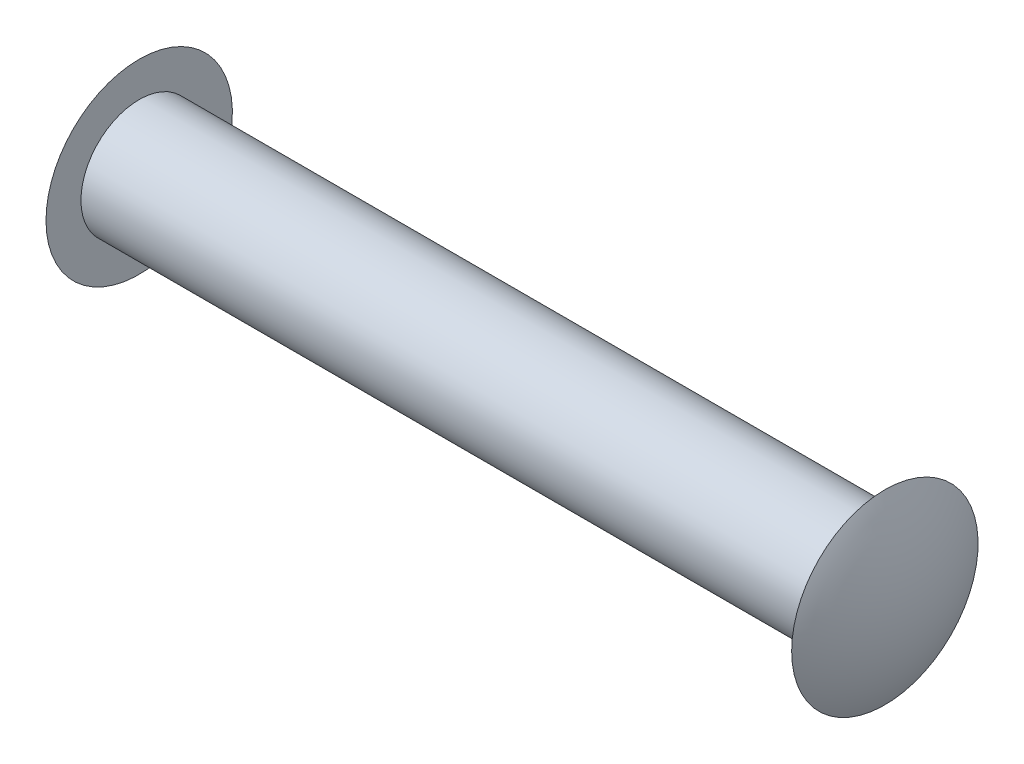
ISO-10303-21;
HEADER;
FILE_DESCRIPTION(('STEP AP214'),'2;1');
FILE_NAME('part.step','',(''),(''),'','','');
FILE_SCHEMA(('AUTOMOTIVE_DESIGN { 1 0 10303 214 1 1 1 1 }'));
ENDSEC;
DATA;
#1=APPLICATION_CONTEXT('core data for automotive mechanical design processes');
#2=APPLICATION_PROTOCOL_DEFINITION('international standard','automotive_design',2000,#1);
#3=PRODUCT_CONTEXT('',#1,'mechanical');
#4=PRODUCT('Part','Part','',(#3));
#5=PRODUCT_RELATED_PRODUCT_CATEGORY('part','',(#4));
#6=PRODUCT_DEFINITION_FORMATION('','',#4);
#7=PRODUCT_DEFINITION_CONTEXT('part definition',#1,'design');
#8=PRODUCT_DEFINITION('design','',#6,#7);
#9=PRODUCT_DEFINITION_SHAPE('','',#8);
#10=(LENGTH_UNIT() NAMED_UNIT(*) SI_UNIT(.MILLI.,.METRE.));
#11=(NAMED_UNIT(*) PLANE_ANGLE_UNIT() SI_UNIT($,.RADIAN.));
#12=(NAMED_UNIT(*) SI_UNIT($,.STERADIAN.) SOLID_ANGLE_UNIT());
#13=UNCERTAINTY_MEASURE_WITH_UNIT(LENGTH_MEASURE(1.E-05),#10,'distance_accuracy_value','');
#14=(GEOMETRIC_REPRESENTATION_CONTEXT(3) GLOBAL_UNCERTAINTY_ASSIGNED_CONTEXT((#13)) GLOBAL_UNIT_ASSIGNED_CONTEXT((#10,
#11,#12)) REPRESENTATION_CONTEXT('',''));
#15=CARTESIAN_POINT('',(0.,0.,0.));
#16=DIRECTION('',(0.,0.,1.));
#17=DIRECTION('',(1.,0.,0.));
#18=AXIS2_PLACEMENT_3D('',#15,#16,#17);
#19=CARTESIAN_POINT('',(0.,0.,0.));
#20=DIRECTION('',(-1.,0.,0.));
#21=DIRECTION('',(0.,0.,1.));
#22=AXIS2_PLACEMENT_3D('',#19,#20,#21);
#23=CYLINDRICAL_SURFACE('',#22,2.5);
#24=CARTESIAN_POINT('',(16.,0.,0.));
#25=DIRECTION('',(-1.,0.,0.));
#26=DIRECTION('',(0.,0.,1.));
#27=AXIS2_PLACEMENT_3D('',#24,#25,#26);
#28=CIRCLE('',#27,2.5);
#29=CARTESIAN_POINT('',(16.,0.,2.5));
#30=VERTEX_POINT('',#29);
#31=EDGE_CURVE('E10',#30,#30,#28,.T.);
#32=ORIENTED_EDGE('',*,*,#31,.T.);
#33=EDGE_LOOP('',(#32));
#34=FACE_BOUND('',#33,.T.);
#35=CARTESIAN_POINT('',(-16.,0.,0.));
#36=DIRECTION('',(-1.,0.,0.));
#37=DIRECTION('',(0.,0.,1.));
#38=AXIS2_PLACEMENT_3D('',#35,#36,#37);
#39=CIRCLE('',#38,2.5);
#40=CARTESIAN_POINT('',(-16.,0.,2.5));
#41=VERTEX_POINT('',#40);
#42=EDGE_CURVE('E42',#41,#41,#39,.T.);
#43=ORIENTED_EDGE('',*,*,#42,.F.);
#44=EDGE_LOOP('',(#43));
#45=FACE_BOUND('',#44,.T.);
#46=ADVANCED_FACE('F32',(#34,#45),#23,.T.);
#47=CARTESIAN_POINT('',(16.,2.5,0.));
#48=DIRECTION('',(1.,0.,0.));
#49=DIRECTION('',(0.,0.,-1.));
#50=AXIS2_PLACEMENT_3D('',#47,#48,#49);
#51=PLANE('',#50);
#52=ORIENTED_EDGE('',*,*,#31,.F.);
#53=EDGE_LOOP('',(#52));
#54=FACE_BOUND('',#53,.T.);
#55=CARTESIAN_POINT('',(16.,0.,0.));
#56=DIRECTION('',(-1.,0.,0.));
#57=DIRECTION('',(0.,0.,1.));
#58=AXIS2_PLACEMENT_3D('',#55,#56,#57);
#59=CIRCLE('',#58,4.);
#60=CARTESIAN_POINT('',(16.,0.,4.));
#61=VERTEX_POINT('',#60);
#62=EDGE_CURVE('E38',#61,#61,#59,.T.);
#63=ORIENTED_EDGE('',*,*,#62,.T.);
#64=EDGE_LOOP('',(#63));
#65=FACE_BOUND('',#64,.T.);
#66=ADVANCED_FACE('F64',(#54,#65),#51,.F.);
#67=CARTESIAN_POINT('',(8.50000000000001,0.,0.));
#68=DIRECTION('',(-1.,0.,0.));
#69=DIRECTION('',(0.,1.,0.));
#70=AXIS2_PLACEMENT_3D('',#67,#68,#69);
#71=SPHERICAL_SURFACE('',#70,8.49999999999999);
#72=ORIENTED_EDGE('',*,*,#62,.F.);
#73=EDGE_LOOP('',(#72));
#74=FACE_BOUND('',#73,.T.);
#75=ADVANCED_FACE('F56',(#74),#71,.T.);
#76=CARTESIAN_POINT('',(-16.,2.5,0.));
#77=DIRECTION('',(-1.,0.,0.));
#78=DIRECTION('',(0.,0.,-1.));
#79=AXIS2_PLACEMENT_3D('',#76,#77,#78);
#80=PLANE('',#79);
#81=ORIENTED_EDGE('',*,*,#42,.T.);
#82=EDGE_LOOP('',(#81));
#83=FACE_BOUND('',#82,.T.);
#84=CARTESIAN_POINT('',(-16.,0.,0.));
#85=DIRECTION('',(-1.,0.,0.));
#86=DIRECTION('',(0.,0.,1.));
#87=AXIS2_PLACEMENT_3D('',#84,#85,#86);
#88=CIRCLE('',#87,4.);
#89=CARTESIAN_POINT('',(-16.,0.,4.));
#90=VERTEX_POINT('',#89);
#91=EDGE_CURVE('E46',#90,#90,#88,.T.);
#92=ORIENTED_EDGE('',*,*,#91,.F.);
#93=EDGE_LOOP('',(#92));
#94=FACE_BOUND('',#93,.T.);
#95=ADVANCED_FACE('F54',(#83,#94),#80,.F.);
#96=CARTESIAN_POINT('',(-8.50000000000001,0.,0.));
#97=DIRECTION('',(1.,0.,0.));
#98=DIRECTION('',(0.,1.,0.));
#99=AXIS2_PLACEMENT_3D('',#96,#97,#98);
#100=SPHERICAL_SURFACE('',#99,8.49999999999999);
#101=ORIENTED_EDGE('',*,*,#91,.T.);
#102=EDGE_LOOP('',(#101));
#103=FACE_BOUND('',#102,.T.);
#104=ADVANCED_FACE('F52',(#103),#100,.T.);
#105=CLOSED_SHELL('',(#46,#66,#75,#95,#104));
#106=MANIFOLD_SOLID_BREP('B2',#105);
#107=ADVANCED_BREP_SHAPE_REPRESENTATION('',(#18,#106),#14);
#108=SHAPE_DEFINITION_REPRESENTATION(#9,#107);
ENDSEC;
END-ISO-10303-21;
